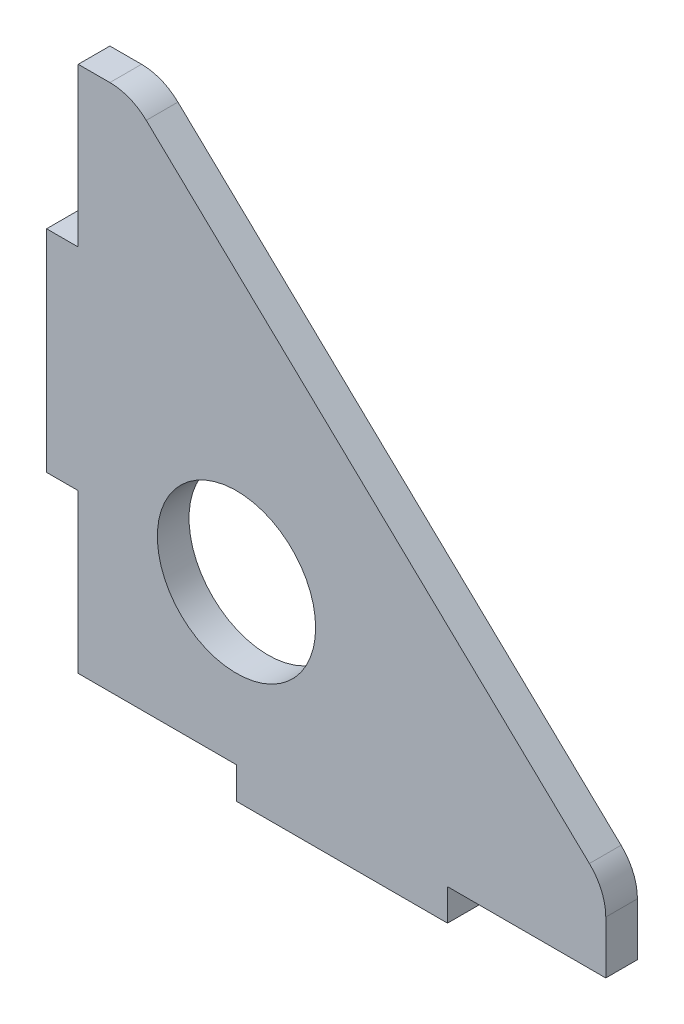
ISO-10303-21;
HEADER;
FILE_DESCRIPTION(('STEP AP214'),'2;1');
FILE_NAME('part.step','',(''),(''),'','','');
FILE_SCHEMA(('AUTOMOTIVE_DESIGN { 1 0 10303 214 1 1 1 1 }'));
ENDSEC;
DATA;
#1=APPLICATION_CONTEXT('core data for automotive mechanical design processes');
#2=APPLICATION_PROTOCOL_DEFINITION('international standard','automotive_design',2000,#1);
#3=PRODUCT_CONTEXT('',#1,'mechanical');
#4=PRODUCT('Part','Part','',(#3));
#5=PRODUCT_RELATED_PRODUCT_CATEGORY('part','',(#4));
#6=PRODUCT_DEFINITION_FORMATION('','',#4);
#7=PRODUCT_DEFINITION_CONTEXT('part definition',#1,'design');
#8=PRODUCT_DEFINITION('design','',#6,#7);
#9=PRODUCT_DEFINITION_SHAPE('','',#8);
#10=(LENGTH_UNIT() NAMED_UNIT(*) SI_UNIT(.MILLI.,.METRE.));
#11=(NAMED_UNIT(*) PLANE_ANGLE_UNIT() SI_UNIT($,.RADIAN.));
#12=(NAMED_UNIT(*) SI_UNIT($,.STERADIAN.) SOLID_ANGLE_UNIT());
#13=UNCERTAINTY_MEASURE_WITH_UNIT(LENGTH_MEASURE(1.E-05),#10,'distance_accuracy_value','');
#14=(GEOMETRIC_REPRESENTATION_CONTEXT(3) GLOBAL_UNCERTAINTY_ASSIGNED_CONTEXT((#13)) GLOBAL_UNIT_ASSIGNED_CONTEXT((#10,
#11,#12)) REPRESENTATION_CONTEXT('',''));
#15=CARTESIAN_POINT('',(0.,0.,0.));
#16=DIRECTION('',(0.,0.,1.));
#17=DIRECTION('',(1.,0.,0.));
#18=AXIS2_PLACEMENT_3D('',#15,#16,#17);
#19=CARTESIAN_POINT('',(3.,45.,3.));
#20=DIRECTION('',(0.,0.,-1.));
#21=DIRECTION('',(-1.,0.,0.));
#22=AXIS2_PLACEMENT_3D('',#19,#20,#21);
#23=PLANE('',#22);
#24=DIRECTION('',(1.,0.,0.));
#25=VECTOR('',#24,1.);
#26=CARTESIAN_POINT('',(15.,0.,3.));
#27=LINE('',#26,#25);
#28=CARTESIAN_POINT('',(0.,0.,3.));
#29=VERTEX_POINT('',#28);
#30=CARTESIAN_POINT('',(15.,0.,3.));
#31=VERTEX_POINT('',#30);
#32=EDGE_CURVE('E201',#29,#31,#27,.T.);
#33=ORIENTED_EDGE('',*,*,#32,.T.);
#34=DIRECTION('',(0.,-1.,0.));
#35=VECTOR('',#34,1.);
#36=CARTESIAN_POINT('',(15.,0.,3.));
#37=LINE('',#36,#35);
#38=CARTESIAN_POINT('',(15.,-3.,3.));
#39=VERTEX_POINT('',#38);
#40=EDGE_CURVE('E114',#31,#39,#37,.T.);
#41=ORIENTED_EDGE('',*,*,#40,.T.);
#42=DIRECTION('',(1.,0.,0.));
#43=VECTOR('',#42,1.);
#44=CARTESIAN_POINT('',(15.,-3.,3.));
#45=LINE('',#44,#43);
#46=CARTESIAN_POINT('',(35.,-3.,3.));
#47=VERTEX_POINT('',#46);
#48=EDGE_CURVE('E237',#39,#47,#45,.T.);
#49=ORIENTED_EDGE('',*,*,#48,.T.);
#50=DIRECTION('',(0.,1.,0.));
#51=VECTOR('',#50,1.);
#52=CARTESIAN_POINT('',(35.,-3.,3.));
#53=LINE('',#52,#51);
#54=CARTESIAN_POINT('',(35.,0.,3.));
#55=VERTEX_POINT('',#54);
#56=EDGE_CURVE('E256',#47,#55,#53,.T.);
#57=ORIENTED_EDGE('',*,*,#56,.T.);
#58=DIRECTION('',(1.,0.,0.));
#59=VECTOR('',#58,1.);
#60=CARTESIAN_POINT('',(50.,0.,3.));
#61=LINE('',#60,#59);
#62=CARTESIAN_POINT('',(50.,0.,3.));
#63=VERTEX_POINT('',#62);
#64=EDGE_CURVE('E253',#55,#63,#61,.T.);
#65=ORIENTED_EDGE('',*,*,#64,.T.);
#66=DIRECTION('',(0.,1.,0.));
#67=VECTOR('',#66,1.);
#68=CARTESIAN_POINT('',(50.,5.,3.));
#69=LINE('',#68,#67);
#70=CARTESIAN_POINT('',(50.,5.,3.));
#71=VERTEX_POINT('',#70);
#72=EDGE_CURVE('E255',#63,#71,#69,.T.);
#73=ORIENTED_EDGE('',*,*,#72,.T.);
#74=CARTESIAN_POINT('',(45.,5.,3.));
#75=DIRECTION('',(0.,0.,1.));
#76=DIRECTION('',(-1.,0.,0.));
#77=AXIS2_PLACEMENT_3D('',#74,#75,#76);
#78=CIRCLE('',#77,5.);
#79=CARTESIAN_POINT('',(48.448275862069,8.62068965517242,3.));
#80=VERTEX_POINT('',#79);
#81=EDGE_CURVE('E258',#71,#80,#78,.T.);
#82=ORIENTED_EDGE('',*,*,#81,.T.);
#83=DIRECTION('',(-0.724137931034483,0.689655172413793,0.));
#84=VECTOR('',#83,1.);
#85=CARTESIAN_POINT('',(6.44827586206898,48.6206896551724,3.));
#86=LINE('',#85,#84);
#87=CARTESIAN_POINT('',(6.44827586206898,48.6206896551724,3.));
#88=VERTEX_POINT('',#87);
#89=EDGE_CURVE('E264',#80,#88,#86,.T.);
#90=ORIENTED_EDGE('',*,*,#89,.T.);
#91=CARTESIAN_POINT('',(3.,45.,3.));
#92=DIRECTION('',(0.,0.,1.));
#93=DIRECTION('',(-1.,0.,0.));
#94=AXIS2_PLACEMENT_3D('',#91,#92,#93);
#95=CIRCLE('',#94,5.);
#96=CARTESIAN_POINT('',(2.99999999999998,50.,3.));
#97=VERTEX_POINT('',#96);
#98=EDGE_CURVE('E266',#88,#97,#95,.T.);
#99=ORIENTED_EDGE('',*,*,#98,.T.);
#100=DIRECTION('',(-1.,0.,0.));
#101=VECTOR('',#100,1.);
#102=CARTESIAN_POINT('',(0.,50.,3.));
#103=LINE('',#102,#101);
#104=CARTESIAN_POINT('',(0.,50.,3.));
#105=VERTEX_POINT('',#104);
#106=EDGE_CURVE('E268',#97,#105,#103,.T.);
#107=ORIENTED_EDGE('',*,*,#106,.T.);
#108=DIRECTION('',(0.,-1.,0.));
#109=VECTOR('',#108,1.);
#110=CARTESIAN_POINT('',(0.,35.,3.));
#111=LINE('',#110,#109);
#112=CARTESIAN_POINT('',(0.,35.,3.));
#113=VERTEX_POINT('',#112);
#114=EDGE_CURVE('E270',#105,#113,#111,.T.);
#115=ORIENTED_EDGE('',*,*,#114,.T.);
#116=DIRECTION('',(-1.,0.,0.));
#117=VECTOR('',#116,1.);
#118=CARTESIAN_POINT('',(-3.,35.,3.));
#119=LINE('',#118,#117);
#120=CARTESIAN_POINT('',(-3.,35.,3.));
#121=VERTEX_POINT('',#120);
#122=EDGE_CURVE('E154',#113,#121,#119,.T.);
#123=ORIENTED_EDGE('',*,*,#122,.T.);
#124=DIRECTION('',(0.,-1.,0.));
#125=VECTOR('',#124,1.);
#126=CARTESIAN_POINT('',(-3.,15.,3.));
#127=LINE('',#126,#125);
#128=CARTESIAN_POINT('',(-3.,15.,3.));
#129=VERTEX_POINT('',#128);
#130=EDGE_CURVE('E148',#121,#129,#127,.T.);
#131=ORIENTED_EDGE('',*,*,#130,.T.);
#132=DIRECTION('',(1.,0.,0.));
#133=VECTOR('',#132,1.);
#134=CARTESIAN_POINT('',(0.,15.,3.));
#135=LINE('',#134,#133);
#136=CARTESIAN_POINT('',(0.,15.,3.));
#137=VERTEX_POINT('',#136);
#138=EDGE_CURVE('E152',#129,#137,#135,.T.);
#139=ORIENTED_EDGE('',*,*,#138,.T.);
#140=DIRECTION('',(0.,-1.,0.));
#141=VECTOR('',#140,1.);
#142=CARTESIAN_POINT('',(0.,0.,3.));
#143=LINE('',#142,#141);
#144=EDGE_CURVE('E50',#137,#29,#143,.T.);
#145=ORIENTED_EDGE('',*,*,#144,.T.);
#146=EDGE_LOOP('',(#33,#41,#49,#57,#65,#73,#82,#90,#99,#107,#115,#123,#131,#139,#145));
#147=FACE_BOUND('',#146,.T.);
#148=CARTESIAN_POINT('',(15.,15.,3.));
#149=DIRECTION('',(0.,0.,1.));
#150=DIRECTION('',(1.,0.,0.));
#151=AXIS2_PLACEMENT_3D('',#148,#149,#150);
#152=CIRCLE('',#151,7.5);
#153=CARTESIAN_POINT('',(22.5,15.,3.));
#154=VERTEX_POINT('',#153);
#155=EDGE_CURVE('E176',#154,#154,#152,.T.);
#156=ORIENTED_EDGE('',*,*,#155,.F.);
#157=EDGE_LOOP('',(#156));
#158=FACE_BOUND('',#157,.T.);
#159=ADVANCED_FACE('F33',(#147,#158),#23,.F.);
#160=CARTESIAN_POINT('',(3.,45.,0.));
#161=DIRECTION('',(0.,0.,-1.));
#162=DIRECTION('',(-1.,0.,0.));
#163=AXIS2_PLACEMENT_3D('',#160,#161,#162);
#164=PLANE('',#163);
#165=DIRECTION('',(1.,0.,0.));
#166=VECTOR('',#165,1.);
#167=CARTESIAN_POINT('',(15.,0.,0.));
#168=LINE('',#167,#166);
#169=CARTESIAN_POINT('',(0.,0.,0.));
#170=VERTEX_POINT('',#169);
#171=CARTESIAN_POINT('',(15.,0.,0.));
#172=VERTEX_POINT('',#171);
#173=EDGE_CURVE('E172',#170,#172,#168,.T.);
#174=ORIENTED_EDGE('',*,*,#173,.F.);
#175=DIRECTION('',(0.,-1.,0.));
#176=VECTOR('',#175,1.);
#177=CARTESIAN_POINT('',(0.,0.,0.));
#178=LINE('',#177,#176);
#179=CARTESIAN_POINT('',(0.,15.,0.));
#180=VERTEX_POINT('',#179);
#181=EDGE_CURVE('E106',#180,#170,#178,.T.);
#182=ORIENTED_EDGE('',*,*,#181,.F.);
#183=DIRECTION('',(1.,0.,0.));
#184=VECTOR('',#183,1.);
#185=CARTESIAN_POINT('',(0.,15.,0.));
#186=LINE('',#185,#184);
#187=CARTESIAN_POINT('',(-3.,15.,0.));
#188=VERTEX_POINT('',#187);
#189=EDGE_CURVE('E100',#188,#180,#186,.T.);
#190=ORIENTED_EDGE('',*,*,#189,.F.);
#191=DIRECTION('',(0.,-1.,0.));
#192=VECTOR('',#191,1.);
#193=CARTESIAN_POINT('',(-3.,15.,0.));
#194=LINE('',#193,#192);
#195=CARTESIAN_POINT('',(-3.,35.,0.));
#196=VERTEX_POINT('',#195);
#197=EDGE_CURVE('E162',#196,#188,#194,.T.);
#198=ORIENTED_EDGE('',*,*,#197,.F.);
#199=DIRECTION('',(-1.,0.,0.));
#200=VECTOR('',#199,1.);
#201=CARTESIAN_POINT('',(-3.,35.,0.));
#202=LINE('',#201,#200);
#203=CARTESIAN_POINT('',(0.,35.,0.));
#204=VERTEX_POINT('',#203);
#205=EDGE_CURVE('E196',#204,#196,#202,.T.);
#206=ORIENTED_EDGE('',*,*,#205,.F.);
#207=DIRECTION('',(0.,-1.,0.));
#208=VECTOR('',#207,1.);
#209=CARTESIAN_POINT('',(0.,35.,0.));
#210=LINE('',#209,#208);
#211=CARTESIAN_POINT('',(0.,50.,0.));
#212=VERTEX_POINT('',#211);
#213=EDGE_CURVE('E194',#212,#204,#210,.T.);
#214=ORIENTED_EDGE('',*,*,#213,.F.);
#215=DIRECTION('',(-1.,0.,0.));
#216=VECTOR('',#215,1.);
#217=CARTESIAN_POINT('',(0.,50.,0.));
#218=LINE('',#217,#216);
#219=CARTESIAN_POINT('',(2.99999999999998,50.,0.));
#220=VERTEX_POINT('',#219);
#221=EDGE_CURVE('E192',#220,#212,#218,.T.);
#222=ORIENTED_EDGE('',*,*,#221,.F.);
#223=CARTESIAN_POINT('',(3.,45.,0.));
#224=DIRECTION('',(0.,0.,1.));
#225=DIRECTION('',(-1.,0.,0.));
#226=AXIS2_PLACEMENT_3D('',#223,#224,#225);
#227=CIRCLE('',#226,5.);
#228=CARTESIAN_POINT('',(6.44827586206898,48.6206896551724,0.));
#229=VERTEX_POINT('',#228);
#230=EDGE_CURVE('E190',#229,#220,#227,.T.);
#231=ORIENTED_EDGE('',*,*,#230,.F.);
#232=DIRECTION('',(-0.724137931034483,0.689655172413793,0.));
#233=VECTOR('',#232,1.);
#234=CARTESIAN_POINT('',(6.44827586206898,48.6206896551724,0.));
#235=LINE('',#234,#233);
#236=CARTESIAN_POINT('',(48.448275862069,8.62068965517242,0.));
#237=VERTEX_POINT('',#236);
#238=EDGE_CURVE('E188',#237,#229,#235,.T.);
#239=ORIENTED_EDGE('',*,*,#238,.F.);
#240=CARTESIAN_POINT('',(45.,5.,0.));
#241=DIRECTION('',(0.,0.,1.));
#242=DIRECTION('',(-1.,0.,0.));
#243=AXIS2_PLACEMENT_3D('',#240,#241,#242);
#244=CIRCLE('',#243,5.);
#245=CARTESIAN_POINT('',(50.,5.,0.));
#246=VERTEX_POINT('',#245);
#247=EDGE_CURVE('E186',#246,#237,#244,.T.);
#248=ORIENTED_EDGE('',*,*,#247,.F.);
#249=DIRECTION('',(0.,1.,0.));
#250=VECTOR('',#249,1.);
#251=CARTESIAN_POINT('',(50.,5.,0.));
#252=LINE('',#251,#250);
#253=CARTESIAN_POINT('',(50.,0.,0.));
#254=VERTEX_POINT('',#253);
#255=EDGE_CURVE('E184',#254,#246,#252,.T.);
#256=ORIENTED_EDGE('',*,*,#255,.F.);
#257=DIRECTION('',(1.,0.,0.));
#258=VECTOR('',#257,1.);
#259=CARTESIAN_POINT('',(50.,0.,0.));
#260=LINE('',#259,#258);
#261=CARTESIAN_POINT('',(35.,0.,0.));
#262=VERTEX_POINT('',#261);
#263=EDGE_CURVE('E182',#262,#254,#260,.T.);
#264=ORIENTED_EDGE('',*,*,#263,.F.);
#265=DIRECTION('',(0.,1.,0.));
#266=VECTOR('',#265,1.);
#267=CARTESIAN_POINT('',(35.,-3.,0.));
#268=LINE('',#267,#266);
#269=CARTESIAN_POINT('',(35.,-3.,0.));
#270=VERTEX_POINT('',#269);
#271=EDGE_CURVE('E180',#270,#262,#268,.T.);
#272=ORIENTED_EDGE('',*,*,#271,.F.);
#273=DIRECTION('',(1.,0.,0.));
#274=VECTOR('',#273,1.);
#275=CARTESIAN_POINT('',(15.,-3.,0.));
#276=LINE('',#275,#274);
#277=CARTESIAN_POINT('',(15.,-3.,0.));
#278=VERTEX_POINT('',#277);
#279=EDGE_CURVE('E178',#278,#270,#276,.T.);
#280=ORIENTED_EDGE('',*,*,#279,.F.);
#281=DIRECTION('',(0.,-1.,0.));
#282=VECTOR('',#281,1.);
#283=CARTESIAN_POINT('',(15.,0.,0.));
#284=LINE('',#283,#282);
#285=EDGE_CURVE('E175',#172,#278,#284,.T.);
#286=ORIENTED_EDGE('',*,*,#285,.F.);
#287=EDGE_LOOP('',(#174,#182,#190,#198,#206,#214,#222,#231,#239,#248,#256,#264,#272,#280,#286));
#288=FACE_BOUND('',#287,.T.);
#289=CARTESIAN_POINT('',(15.,15.,0.));
#290=DIRECTION('',(0.,0.,1.));
#291=DIRECTION('',(1.,0.,0.));
#292=AXIS2_PLACEMENT_3D('',#289,#290,#291);
#293=CIRCLE('',#292,7.5);
#294=CARTESIAN_POINT('',(22.5,15.,0.));
#295=VERTEX_POINT('',#294);
#296=EDGE_CURVE('E456',#295,#295,#293,.T.);
#297=ORIENTED_EDGE('',*,*,#296,.T.);
#298=EDGE_LOOP('',(#297));
#299=FACE_BOUND('',#298,.T.);
#300=ADVANCED_FACE('F241',(#288,#299),#164,.T.);
#301=CARTESIAN_POINT('',(15.,0.,3.));
#302=DIRECTION('',(0.,1.,0.));
#303=DIRECTION('',(-1.,0.,0.));
#304=AXIS2_PLACEMENT_3D('',#301,#302,#303);
#305=PLANE('',#304);
#306=ORIENTED_EDGE('',*,*,#173,.T.);
#307=DIRECTION('',(0.,0.,-1.));
#308=VECTOR('',#307,1.);
#309=CARTESIAN_POINT('',(15.,0.,3.));
#310=LINE('',#309,#308);
#311=EDGE_CURVE('E11',#31,#172,#310,.T.);
#312=ORIENTED_EDGE('',*,*,#311,.F.);
#313=ORIENTED_EDGE('',*,*,#32,.F.);
#314=DIRECTION('',(0.,0.,-1.));
#315=VECTOR('',#314,1.);
#316=CARTESIAN_POINT('',(0.,0.,3.));
#317=LINE('',#316,#315);
#318=EDGE_CURVE('E168',#29,#170,#317,.T.);
#319=ORIENTED_EDGE('',*,*,#318,.T.);
#320=EDGE_LOOP('',(#306,#312,#313,#319));
#321=FACE_BOUND('',#320,.T.);
#322=ADVANCED_FACE('F35',(#321),#305,.F.);
#323=CARTESIAN_POINT('',(15.,0.,3.));
#324=DIRECTION('',(1.,0.,0.));
#325=DIRECTION('',(0.,0.,-1.));
#326=AXIS2_PLACEMENT_3D('',#323,#324,#325);
#327=PLANE('',#326);
#328=ORIENTED_EDGE('',*,*,#285,.T.);
#329=DIRECTION('',(0.,0.,-1.));
#330=VECTOR('',#329,1.);
#331=CARTESIAN_POINT('',(15.,-3.,3.));
#332=LINE('',#331,#330);
#333=EDGE_CURVE('E42',#39,#278,#332,.T.);
#334=ORIENTED_EDGE('',*,*,#333,.F.);
#335=ORIENTED_EDGE('',*,*,#40,.F.);
#336=ORIENTED_EDGE('',*,*,#311,.T.);
#337=EDGE_LOOP('',(#328,#334,#335,#336));
#338=FACE_BOUND('',#337,.T.);
#339=ADVANCED_FACE('F304',(#338),#327,.F.);
#340=CARTESIAN_POINT('',(15.,-3.,3.));
#341=DIRECTION('',(0.,1.,0.));
#342=DIRECTION('',(0.,0.,1.));
#343=AXIS2_PLACEMENT_3D('',#340,#341,#342);
#344=PLANE('',#343);
#345=ORIENTED_EDGE('',*,*,#279,.T.);
#346=DIRECTION('',(0.,0.,-1.));
#347=VECTOR('',#346,1.);
#348=CARTESIAN_POINT('',(35.,-3.,3.));
#349=LINE('',#348,#347);
#350=EDGE_CURVE('E229',#47,#270,#349,.T.);
#351=ORIENTED_EDGE('',*,*,#350,.F.);
#352=ORIENTED_EDGE('',*,*,#48,.F.);
#353=ORIENTED_EDGE('',*,*,#333,.T.);
#354=EDGE_LOOP('',(#345,#351,#352,#353));
#355=FACE_BOUND('',#354,.T.);
#356=ADVANCED_FACE('F235',(#355),#344,.F.);
#357=CARTESIAN_POINT('',(35.,-3.,3.));
#358=DIRECTION('',(-1.,0.,0.));
#359=DIRECTION('',(0.,0.,1.));
#360=AXIS2_PLACEMENT_3D('',#357,#358,#359);
#361=PLANE('',#360);
#362=ORIENTED_EDGE('',*,*,#271,.T.);
#363=DIRECTION('',(0.,0.,-1.));
#364=VECTOR('',#363,1.);
#365=CARTESIAN_POINT('',(35.,0.,3.));
#366=LINE('',#365,#364);
#367=EDGE_CURVE('E226',#55,#262,#366,.T.);
#368=ORIENTED_EDGE('',*,*,#367,.F.);
#369=ORIENTED_EDGE('',*,*,#56,.F.);
#370=ORIENTED_EDGE('',*,*,#350,.T.);
#371=EDGE_LOOP('',(#362,#368,#369,#370));
#372=FACE_BOUND('',#371,.T.);
#373=ADVANCED_FACE('F247',(#372),#361,.F.);
#374=CARTESIAN_POINT('',(50.,0.,3.));
#375=DIRECTION('',(0.,1.,0.));
#376=DIRECTION('',(-1.,0.,0.));
#377=AXIS2_PLACEMENT_3D('',#374,#375,#376);
#378=PLANE('',#377);
#379=ORIENTED_EDGE('',*,*,#263,.T.);
#380=DIRECTION('',(0.,0.,-1.));
#381=VECTOR('',#380,1.);
#382=CARTESIAN_POINT('',(50.,0.,3.));
#383=LINE('',#382,#381);
#384=EDGE_CURVE('E223',#63,#254,#383,.T.);
#385=ORIENTED_EDGE('',*,*,#384,.F.);
#386=ORIENTED_EDGE('',*,*,#64,.F.);
#387=ORIENTED_EDGE('',*,*,#367,.T.);
#388=EDGE_LOOP('',(#379,#385,#386,#387));
#389=FACE_BOUND('',#388,.T.);
#390=ADVANCED_FACE('F251',(#389),#378,.F.);
#391=CARTESIAN_POINT('',(50.,5.,3.));
#392=DIRECTION('',(-1.,0.,0.));
#393=DIRECTION('',(0.,0.,1.));
#394=AXIS2_PLACEMENT_3D('',#391,#392,#393);
#395=PLANE('',#394);
#396=ORIENTED_EDGE('',*,*,#255,.T.);
#397=DIRECTION('',(0.,0.,-1.));
#398=VECTOR('',#397,1.);
#399=CARTESIAN_POINT('',(50.,5.,3.));
#400=LINE('',#399,#398);
#401=EDGE_CURVE('E220',#71,#246,#400,.T.);
#402=ORIENTED_EDGE('',*,*,#401,.F.);
#403=ORIENTED_EDGE('',*,*,#72,.F.);
#404=ORIENTED_EDGE('',*,*,#384,.T.);
#405=EDGE_LOOP('',(#396,#402,#403,#404));
#406=FACE_BOUND('',#405,.T.);
#407=ADVANCED_FACE('F317',(#406),#395,.F.);
#408=CARTESIAN_POINT('',(45.,5.,3.));
#409=DIRECTION('',(0.,0.,-1.));
#410=DIRECTION('',(-1.,0.,0.));
#411=AXIS2_PLACEMENT_3D('',#408,#409,#410);
#412=CYLINDRICAL_SURFACE('',#411,5.);
#413=ORIENTED_EDGE('',*,*,#247,.T.);
#414=DIRECTION('',(0.,0.,-1.));
#415=VECTOR('',#414,1.);
#416=CARTESIAN_POINT('',(48.448275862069,8.62068965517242,3.));
#417=LINE('',#416,#415);
#418=EDGE_CURVE('E217',#80,#237,#417,.T.);
#419=ORIENTED_EDGE('',*,*,#418,.F.);
#420=ORIENTED_EDGE('',*,*,#81,.F.);
#421=ORIENTED_EDGE('',*,*,#401,.T.);
#422=EDGE_LOOP('',(#413,#419,#420,#421));
#423=FACE_BOUND('',#422,.T.);
#424=ADVANCED_FACE('F320',(#423),#412,.T.);
#425=CARTESIAN_POINT('',(6.44827586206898,48.6206896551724,3.));
#426=DIRECTION('',(-0.689655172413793,-0.724137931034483,0.));
#427=DIRECTION('',(0.724137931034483,-0.689655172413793,0.));
#428=AXIS2_PLACEMENT_3D('',#425,#426,#427);
#429=PLANE('',#428);
#430=ORIENTED_EDGE('',*,*,#238,.T.);
#431=DIRECTION('',(0.,0.,-1.));
#432=VECTOR('',#431,1.);
#433=CARTESIAN_POINT('',(6.44827586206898,48.6206896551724,3.));
#434=LINE('',#433,#432);
#435=EDGE_CURVE('E214',#88,#229,#434,.T.);
#436=ORIENTED_EDGE('',*,*,#435,.F.);
#437=ORIENTED_EDGE('',*,*,#89,.F.);
#438=ORIENTED_EDGE('',*,*,#418,.T.);
#439=EDGE_LOOP('',(#430,#436,#437,#438));
#440=FACE_BOUND('',#439,.T.);
#441=ADVANCED_FACE('F324',(#440),#429,.F.);
#442=CARTESIAN_POINT('',(3.,45.,3.));
#443=DIRECTION('',(0.,0.,-1.));
#444=DIRECTION('',(-1.,0.,0.));
#445=AXIS2_PLACEMENT_3D('',#442,#443,#444);
#446=CYLINDRICAL_SURFACE('',#445,5.);
#447=ORIENTED_EDGE('',*,*,#230,.T.);
#448=DIRECTION('',(0.,0.,-1.));
#449=VECTOR('',#448,1.);
#450=CARTESIAN_POINT('',(2.99999999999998,50.,3.));
#451=LINE('',#450,#449);
#452=EDGE_CURVE('E211',#97,#220,#451,.T.);
#453=ORIENTED_EDGE('',*,*,#452,.F.);
#454=ORIENTED_EDGE('',*,*,#98,.F.);
#455=ORIENTED_EDGE('',*,*,#435,.T.);
#456=EDGE_LOOP('',(#447,#453,#454,#455));
#457=FACE_BOUND('',#456,.T.);
#458=ADVANCED_FACE('F328',(#457),#446,.T.);
#459=CARTESIAN_POINT('',(0.,50.,3.));
#460=DIRECTION('',(0.,-1.,0.));
#461=DIRECTION('',(0.,0.,-1.));
#462=AXIS2_PLACEMENT_3D('',#459,#460,#461);
#463=PLANE('',#462);
#464=ORIENTED_EDGE('',*,*,#221,.T.);
#465=DIRECTION('',(0.,0.,-1.));
#466=VECTOR('',#465,1.);
#467=CARTESIAN_POINT('',(0.,50.,3.));
#468=LINE('',#467,#466);
#469=EDGE_CURVE('E208',#105,#212,#468,.T.);
#470=ORIENTED_EDGE('',*,*,#469,.F.);
#471=ORIENTED_EDGE('',*,*,#106,.F.);
#472=ORIENTED_EDGE('',*,*,#452,.T.);
#473=EDGE_LOOP('',(#464,#470,#471,#472));
#474=FACE_BOUND('',#473,.T.);
#475=ADVANCED_FACE('F332',(#474),#463,.F.);
#476=CARTESIAN_POINT('',(0.,35.,3.));
#477=DIRECTION('',(1.,0.,0.));
#478=DIRECTION('',(0.,0.,-1.));
#479=AXIS2_PLACEMENT_3D('',#476,#477,#478);
#480=PLANE('',#479);
#481=ORIENTED_EDGE('',*,*,#213,.T.);
#482=DIRECTION('',(0.,0.,-1.));
#483=VECTOR('',#482,1.);
#484=CARTESIAN_POINT('',(0.,35.,3.));
#485=LINE('',#484,#483);
#486=EDGE_CURVE('E205',#113,#204,#485,.T.);
#487=ORIENTED_EDGE('',*,*,#486,.F.);
#488=ORIENTED_EDGE('',*,*,#114,.F.);
#489=ORIENTED_EDGE('',*,*,#469,.T.);
#490=EDGE_LOOP('',(#481,#487,#488,#489));
#491=FACE_BOUND('',#490,.T.);
#492=ADVANCED_FACE('F276',(#491),#480,.F.);
#493=CARTESIAN_POINT('',(-3.,35.,3.));
#494=DIRECTION('',(0.,-1.,0.));
#495=DIRECTION('',(1.,0.,0.));
#496=AXIS2_PLACEMENT_3D('',#493,#494,#495);
#497=PLANE('',#496);
#498=ORIENTED_EDGE('',*,*,#205,.T.);
#499=DIRECTION('',(0.,0.,-1.));
#500=VECTOR('',#499,1.);
#501=CARTESIAN_POINT('',(-3.,35.,3.));
#502=LINE('',#501,#500);
#503=EDGE_CURVE('E163',#121,#196,#502,.T.);
#504=ORIENTED_EDGE('',*,*,#503,.F.);
#505=ORIENTED_EDGE('',*,*,#122,.F.);
#506=ORIENTED_EDGE('',*,*,#486,.T.);
#507=EDGE_LOOP('',(#498,#504,#505,#506));
#508=FACE_BOUND('',#507,.T.);
#509=ADVANCED_FACE('F280',(#508),#497,.F.);
#510=CARTESIAN_POINT('',(-3.,15.,3.));
#511=DIRECTION('',(1.,0.,0.));
#512=DIRECTION('',(0.,0.,-1.));
#513=AXIS2_PLACEMENT_3D('',#510,#511,#512);
#514=PLANE('',#513);
#515=ORIENTED_EDGE('',*,*,#197,.T.);
#516=DIRECTION('',(0.,0.,-1.));
#517=VECTOR('',#516,1.);
#518=CARTESIAN_POINT('',(-3.,15.,3.));
#519=LINE('',#518,#517);
#520=EDGE_CURVE('E159',#129,#188,#519,.T.);
#521=ORIENTED_EDGE('',*,*,#520,.F.);
#522=ORIENTED_EDGE('',*,*,#130,.F.);
#523=ORIENTED_EDGE('',*,*,#503,.T.);
#524=EDGE_LOOP('',(#515,#521,#522,#523));
#525=FACE_BOUND('',#524,.T.);
#526=ADVANCED_FACE('F160',(#525),#514,.F.);
#527=CARTESIAN_POINT('',(0.,15.,3.));
#528=DIRECTION('',(0.,1.,0.));
#529=DIRECTION('',(0.,0.,1.));
#530=AXIS2_PLACEMENT_3D('',#527,#528,#529);
#531=PLANE('',#530);
#532=ORIENTED_EDGE('',*,*,#189,.T.);
#533=DIRECTION('',(0.,0.,-1.));
#534=VECTOR('',#533,1.);
#535=CARTESIAN_POINT('',(0.,15.,3.));
#536=LINE('',#535,#534);
#537=EDGE_CURVE('E164',#137,#180,#536,.T.);
#538=ORIENTED_EDGE('',*,*,#537,.F.);
#539=ORIENTED_EDGE('',*,*,#138,.F.);
#540=ORIENTED_EDGE('',*,*,#520,.T.);
#541=EDGE_LOOP('',(#532,#538,#539,#540));
#542=FACE_BOUND('',#541,.T.);
#543=ADVANCED_FACE('F166',(#542),#531,.F.);
#544=CARTESIAN_POINT('',(0.,0.,3.));
#545=DIRECTION('',(1.,0.,0.));
#546=DIRECTION('',(0.,0.,-1.));
#547=AXIS2_PLACEMENT_3D('',#544,#545,#546);
#548=PLANE('',#547);
#549=ORIENTED_EDGE('',*,*,#181,.T.);
#550=ORIENTED_EDGE('',*,*,#318,.F.);
#551=ORIENTED_EDGE('',*,*,#144,.F.);
#552=ORIENTED_EDGE('',*,*,#537,.T.);
#553=EDGE_LOOP('',(#549,#550,#551,#552));
#554=FACE_BOUND('',#553,.T.);
#555=ADVANCED_FACE('F284',(#554),#548,.F.);
#556=CARTESIAN_POINT('',(15.,15.,3.));
#557=DIRECTION('',(0.,0.,-1.));
#558=DIRECTION('',(-1.,0.,0.));
#559=AXIS2_PLACEMENT_3D('',#556,#557,#558);
#560=CYLINDRICAL_SURFACE('',#559,7.5);
#561=ORIENTED_EDGE('',*,*,#155,.T.);
#562=EDGE_LOOP('',(#561));
#563=FACE_BOUND('',#562,.T.);
#564=ORIENTED_EDGE('',*,*,#296,.F.);
#565=EDGE_LOOP('',(#564));
#566=FACE_BOUND('',#565,.T.);
#567=ADVANCED_FACE('F286',(#563,#566),#560,.F.);
#568=CLOSED_SHELL('',(#159,#300,#322,#339,#356,#373,#390,#407,#424,#441,#458,#475,#492,#509,
#526,#543,#555,#567));
#569=MANIFOLD_SOLID_BREP('B2',#568);
#570=ADVANCED_BREP_SHAPE_REPRESENTATION('',(#18,#569),#14);
#571=SHAPE_DEFINITION_REPRESENTATION(#9,#570);
ENDSEC;
END-ISO-10303-21;
